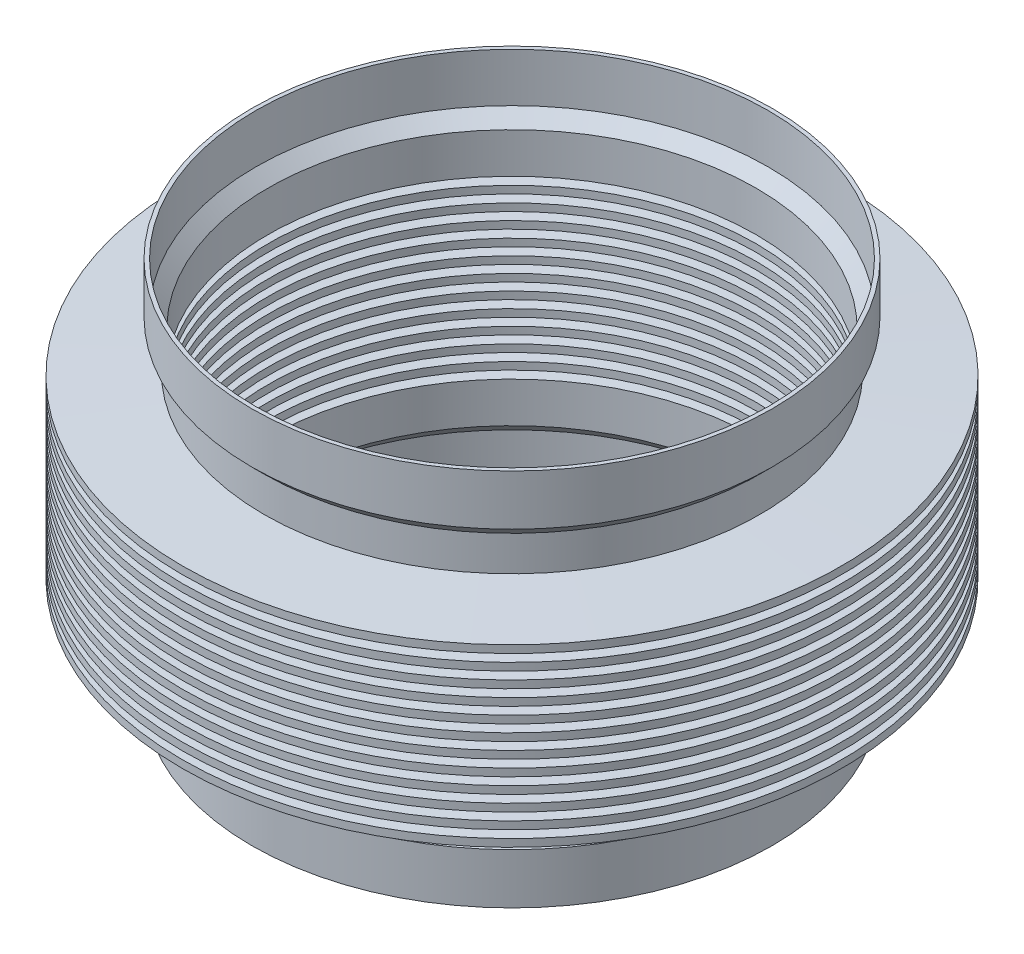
from build123d import *


with BuildPart() as part:
    # Sketch1 → Revolve1 (revolve)
    with BuildSketch(Plane.XY, mode=Mode.PRIVATE) as revolve1_sk:
        Polygon((-67.691, 85.304159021), (-64.516, 82.129159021), (-64.516, 73.025), (-85.725, 72.031249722), (-85.725, 70.050000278), (-64.516, 69.05625), (-85.725, 68.062499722), (-85.725, 66.081250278), (-64.516, 65.0875), (-85.725, 64.093749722), (-85.725, 62.112500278), (-64.516, 61.11875), (-85.725, 60.124999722), (-85.725, 58.143750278), (-64.516, 57.15), (-85.725, 56.156249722), (-85.725, 54.175000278), (-64.516, 53.18125), (-85.725, 52.187499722), (-85.725, 50.206250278), (-64.516, 49.2125), (-85.725, 48.218749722), (-85.725, 46.237500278), (-64.516, 45.24375), (-85.725, 44.249999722), (-85.725, 42.268750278), (-64.516, 41.275), (-85.725, 40.281249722), (-85.725, 38.300000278), (-64.516, 37.30625), (-85.725, 36.312499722), (-85.725, 34.331250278), (-64.516, 33.3375), (-85.725, 32.343749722), (-85.725, 30.362500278), (-64.516, 29.36875), (-85.725, 28.374999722), (-85.725, 26.393750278), (-64.516, 25.4), (-64.516, 16.295840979), (-67.691, 13.120840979), (-67.691, 0), (-66.675, 0), (-66.675, 12.7), (-63.5, 15.875), (-63.5, 26.369509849), (-85.159641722, 27.384375), (-63.5, 28.399240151), (-63.5, 30.338259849), (-85.159641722, 31.353125), (-63.5, 32.367990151), (-63.5, 34.307009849), (-85.159641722, 35.321875), (-63.5, 36.336740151), (-63.5, 38.275759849), (-85.159641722, 39.290625), (-63.5, 40.305490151), (-63.5, 42.244509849), (-85.159641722, 43.259375), (-63.5, 44.274240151), (-63.5, 46.213259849), (-85.159641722, 47.228125), (-63.5, 48.242990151), (-63.5, 50.182009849), (-85.159641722, 51.196875), (-63.5, 52.211740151), (-63.5, 54.150759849), (-85.159641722, 55.165625), (-63.5, 56.180490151), (-63.5, 58.119509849), (-85.159641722, 59.134375), (-63.5, 60.149240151), (-63.5, 62.088259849), (-85.159641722, 63.103125), (-63.5, 64.117990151), (-63.5, 66.057009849), (-85.159641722, 67.071875), (-63.5, 68.086740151), (-63.5, 70.025759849), (-85.159641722, 71.040625), (-63.5, 72.055490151), (-63.5, 82.55), (-66.675, 85.725), (-66.675, 98.425), (-67.691, 98.425), align=None)
    revolve(revolve1_sk.sketch.rotate(Axis((0, 0, 0), (0, 1, 0)), 270), axis=Axis((0, 0, 0), (0, 1, 0)))


solid = part.part
